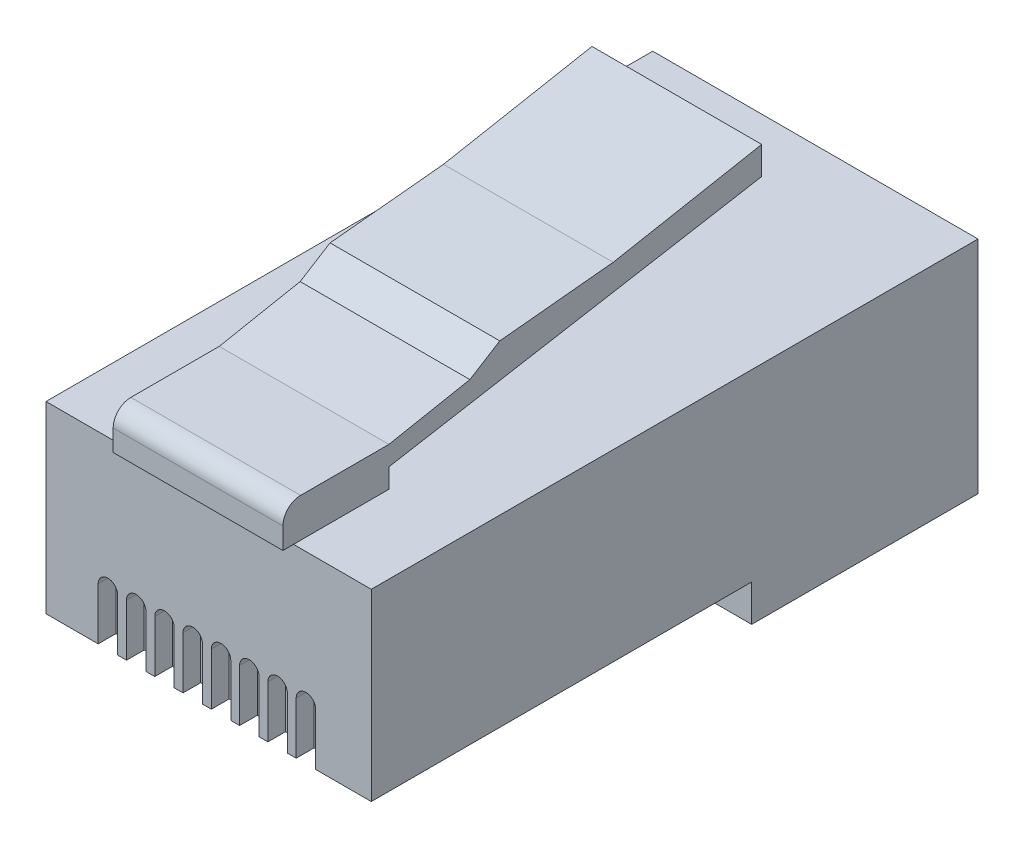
from build123d import *

# Parameters (mm, degrees)
SKETCH1_W           = 11.684
SKETCH1_H           = 6.604
BASE_EXTRUDE_DEPTH  = 21.7932
SKETCH2_W           = 11.684
SKETCH2_H           = 8.129943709
BOSS_EXTRUDE1_DEPTH = 1.3208
SKETCH4_W           = 6.096
SKETCH4_H           = 3.81
BOSS_EXTRUDE3_DEPTH = 1.397
FILLET5_R           = 0.635
CUT_EXTRUDE2_DEPTH  = 4.318
EXTRUDE1_START      = 3.81
EXTRUDE1_DEPTH      = 3.81
LPATTERN4_COUNT     = 8
LPATTERN4_PITCH     = 1.016
BOSS_EXTRUDE5_START = -6.096
BOSS_EXTRUDE5_DEPTH = 6.096
SKETCH13_W          = 10.414
SKETCH13_H          = 0.635
CUT_EXTRUDE6_DEPTH  = 3.175
SKETCH14_W          = 8.1788
SKETCH14_H          = 3.302
CUT_EXTRUDE7_DEPTH  = 1.5875
SKETCH16_W          = 8.1788
SKETCH16_H          = 3.81
CUT_EXTRUDE8_DEPTH  = 3.81
CUT_EXTRUDE10_DEPTH = 15.24


with BuildPart() as part:
    # Sketch1 → Base-Extrude (new body)
    with BuildSketch(Plane.XY):
        Rectangle(SKETCH1_W, SKETCH1_H)
    extrude(amount=BASE_EXTRUDE_DEPTH)

    # Sketch2 → Boss-Extrude1 (add)
    with BuildSketch(Plane.XZ.offset(3.302)):
        with Locations((0, 4.064971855)):
            Rectangle(SKETCH2_W, SKETCH2_H)
    extrude(amount=BOSS_EXTRUDE1_DEPTH)

    # Sketch4 → Boss-Extrude3 (add)
    with BuildSketch(Plane(origin=(0, 3.302, 0), x_dir=(-1, 0, 0), z_dir=(0, 1, 0))):
        with Locations((0, 20.2692)):
            Rectangle(SKETCH4_W, SKETCH4_H)
    extrude(amount=BOSS_EXTRUDE3_DEPTH)

    # Fillet5
    fillet5_edges = [part.edges().sort_by_distance(p)[0] for p in [
        (0, 4.699, 22.1742),
    ]]
    fillet(fillet5_edges, radius=FILLET5_R)

    # Sketch6 → Cut-Extrude2 (cut)
    with BuildSketch(Plane.XY.offset(21.7932)):
        with BuildLine():
            Line((3.84302, -1.43002), (3.84302, -3.302))
            Line((3.84302, -3.302), (3.14452, -3.302))
            Line((3.14452, -3.302), (3.14452, -1.43002))
            ThreePointArc((3.14452, -1.43002), (3.49377, -1.08077), (3.84302, -1.43002))
        make_face()
    cut_extrude2 = extrude(amount=-CUT_EXTRUDE2_DEPTH, mode=Mode.SUBTRACT)

    # Sketch24 → Extrude1 (add)
    with BuildSketch(Plane.XY.offset(17.4752).offset(EXTRUDE1_START)):
        with BuildLine():
            Line((3.27152, -3.175), (3.71602, -3.175))
            Line((3.71602, -3.175), (3.71602, -1.160612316))
            ThreePointArc((3.71602, -1.160612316), (3.49377, -1.08077), (3.27152, -1.160612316))
            Line((3.27152, -1.160612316), (3.27152, -3.175))
        make_face()
    extrude1 = extrude(amount=-EXTRUDE1_DEPTH)

    # LPattern4: Cut-Extrude2, Extrude1 ×8
    with Locations(*[(-i * LPATTERN4_PITCH, 0, 0) for i in range(1, LPATTERN4_COUNT)]):
        add(cut_extrude2, mode=Mode.SUBTRACT)
        add(extrude1)

    # Sketch10 → Boss-Extrude5 (add)
    with BuildSketch(Plane(origin=(3.048, 0, 0), x_dir=(0, 0, -1), z_dir=(1, 0, 0)).offset(BOSS_EXTRUDE5_START)):
        Polygon((-18.3642, 4.0005), (-4.975533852, 6.334865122), (-4.975533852, 7.334939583), (-10.309264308, 6.334865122), (-14.38364174, 5.927427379), (-15.457795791, 5.260711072), (-18.3642, 4.699), align=None)
    extrude(amount=BOSS_EXTRUDE5_DEPTH)

    # Sketch13 → Cut-Extrude6 (cut)
    with BuildSketch(Plane.XZ.offset(3.302)):
        with Locations((0, 16.3957)):
            Rectangle(SKETCH13_W, SKETCH13_H)
    extrude(amount=-CUT_EXTRUDE6_DEPTH, mode=Mode.SUBTRACT)

    # Sketch14 → Cut-Extrude7 (cut)
    with BuildSketch(Plane.XZ.offset(3.302)):
        with Locations((0, 12.1412)):
            Rectangle(SKETCH14_W, SKETCH14_H)
    extrude(amount=-CUT_EXTRUDE7_DEPTH, mode=Mode.SUBTRACT)

    # Sketch16 → Cut-Extrude8 (cut)
    with BuildSketch(Plane.XZ.offset(4.6228)):
        with Locations((0, 4.445)):
            Rectangle(SKETCH16_W, SKETCH16_H)
    extrude(amount=-CUT_EXTRUDE8_DEPTH, mode=Mode.SUBTRACT)

    # Sketch18 → Cut-Extrude10 (cut)
    with BuildSketch(Plane(origin=(0, 0, 0), x_dir=(-1, 0, 0), z_dir=(0, 0, -1))):
        with BuildLine():
            Line((-4.0894, 1.4732), (-4.0894, -2.3876))
            Line((-4.0894, -2.3876), (4.0894, -2.3876))
            Line((4.0894, -2.3876), (4.0894, 1.4732))
            ThreePointArc((4.0894, 1.4732), (0, 1.96344704), (-4.0894, 1.4732))
        make_face()
    extrude(amount=-CUT_EXTRUDE10_DEPTH, mode=Mode.SUBTRACT)


solid = part.part
